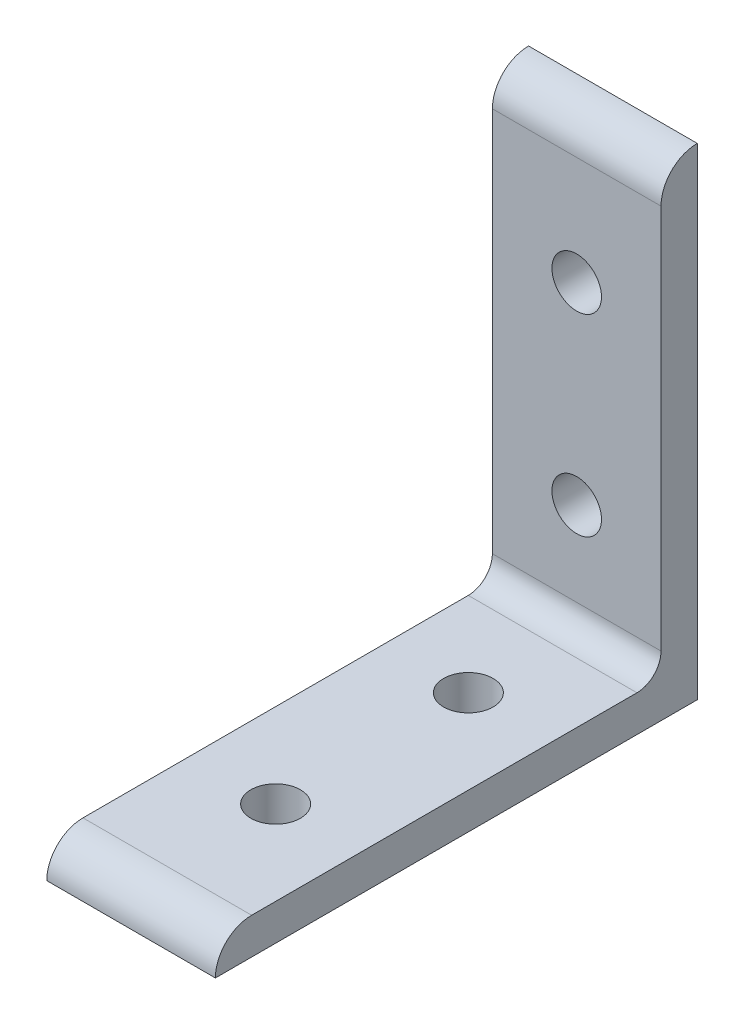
from build123d import *

# Parameters (mm, degrees)
BOSS_EXTRUDE1_DEPTH      = 11.1125
BOSS_EXTRUDE1_DEPTH_BACK = 11.1125
SKETCH2_R                = 3.2639
CUT_EXTRUDE1_DEPTH       = 4.7752
SKETCH3_R                = 3.2639
CUT_EXTRUDE2_DEPTH       = 4.7752
SKETCH4_R                = 3.2639
CUT_EXTRUDE3_DEPTH       = 4.7752
SKETCH5_R                = 3.2639
CUT_EXTRUDE4_DEPTH       = 4.7752


with BuildPart() as part:
    # Sketch1 → Boss-Extrude1 (new, two sides: drawn at the far end of the back side and taken through both)
    with BuildSketch(Plane(origin=(0, 0, 0), x_dir=(0, 0, -1), z_dir=(1, 0, 0)).offset(-BOSS_EXTRUDE1_DEPTH_BACK)):
        with BuildLine():
            Line((-63.5, 0), (0, 0))
            Line((0, 0), (0, 63.5))
            ThreePointArc((0, 63.5), (-3.376576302, 62.101376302), (-4.7752, 58.7248))
            Line((-4.7752, 58.7248), (-4.7752, 7.9502))
            ThreePointArc((-4.7752, 7.9502), (-5.70513597, 5.70513597), (-7.9502, 4.7752))
            Line((-7.9502, 4.7752), (-58.7248, 4.7752))
            ThreePointArc((-58.7248, 4.7752), (-62.101376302, 3.376576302), (-63.5, 0))
        make_face()
    extrude(amount=BOSS_EXTRUDE1_DEPTH + BOSS_EXTRUDE1_DEPTH_BACK)

    # Sketch2 → Cut-Extrude1 (cut)
    with BuildSketch(Plane.XY):
        with Locations((0, 19.05)):
            Circle(SKETCH2_R)
    extrude(amount=CUT_EXTRUDE1_DEPTH, mode=Mode.SUBTRACT)

    # Sketch3 → Cut-Extrude2 (cut)
    with BuildSketch(Plane.XY):
        with Locations((0, 44.45)):
            Circle(SKETCH3_R)
    extrude(amount=CUT_EXTRUDE2_DEPTH, mode=Mode.SUBTRACT)

    # Sketch4 → Cut-Extrude3 (cut)
    with BuildSketch(Plane(origin=(0, 0, 0), x_dir=(1, 0, 0), z_dir=(0, 1, 0))):
        with Locations(Location((0, -19.05, 0), (0, 0, 270))):
            Circle(SKETCH4_R)
    extrude(amount=CUT_EXTRUDE3_DEPTH, mode=Mode.SUBTRACT)

    # Sketch5 → Cut-Extrude4 (cut)
    with BuildSketch(Plane(origin=(0, 0, 0), x_dir=(1, 0, 0), z_dir=(0, 1, 0))):
        with Locations(Location((0, -44.45, 0), (0, 0, 270))):
            Circle(SKETCH5_R)
    extrude(amount=CUT_EXTRUDE4_DEPTH, mode=Mode.SUBTRACT)


solid = part.part
